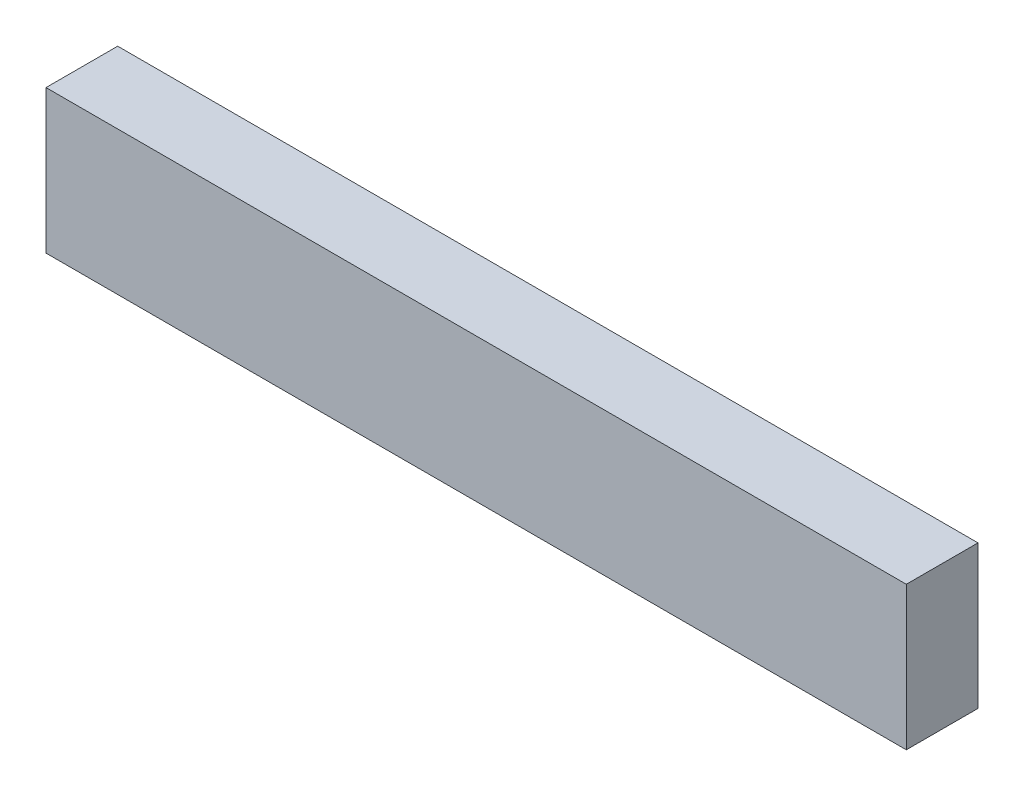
ISO-10303-21;
HEADER;
FILE_DESCRIPTION(('STEP AP214'),'2;1');
FILE_NAME('part.step','',(''),(''),'','','');
FILE_SCHEMA(('AUTOMOTIVE_DESIGN { 1 0 10303 214 1 1 1 1 }'));
ENDSEC;
DATA;
#1=APPLICATION_CONTEXT('core data for automotive mechanical design processes');
#2=APPLICATION_PROTOCOL_DEFINITION('international standard','automotive_design',2000,#1);
#3=PRODUCT_CONTEXT('',#1,'mechanical');
#4=PRODUCT('Part','Part','',(#3));
#5=PRODUCT_RELATED_PRODUCT_CATEGORY('part','',(#4));
#6=PRODUCT_DEFINITION_FORMATION('','',#4);
#7=PRODUCT_DEFINITION_CONTEXT('part definition',#1,'design');
#8=PRODUCT_DEFINITION('design','',#6,#7);
#9=PRODUCT_DEFINITION_SHAPE('','',#8);
#10=(LENGTH_UNIT() NAMED_UNIT(*) SI_UNIT(.MILLI.,.METRE.));
#11=(NAMED_UNIT(*) PLANE_ANGLE_UNIT() SI_UNIT($,.RADIAN.));
#12=(NAMED_UNIT(*) SI_UNIT($,.STERADIAN.) SOLID_ANGLE_UNIT());
#13=UNCERTAINTY_MEASURE_WITH_UNIT(LENGTH_MEASURE(1.E-05),#10,'distance_accuracy_value','');
#14=(GEOMETRIC_REPRESENTATION_CONTEXT(3) GLOBAL_UNCERTAINTY_ASSIGNED_CONTEXT((#13)) GLOBAL_UNIT_ASSIGNED_CONTEXT((#10,
#11,#12)) REPRESENTATION_CONTEXT('',''));
#15=CARTESIAN_POINT('',(0.,0.,0.));
#16=DIRECTION('',(0.,0.,1.));
#17=DIRECTION('',(1.,0.,0.));
#18=AXIS2_PLACEMENT_3D('',#15,#16,#17);
#19=CARTESIAN_POINT('',(-61.8344262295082,9.4469262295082,10.));
#20=DIRECTION('',(1.,0.,0.));
#21=DIRECTION('',(0.,0.,-1.));
#22=AXIS2_PLACEMENT_3D('',#19,#20,#21);
#23=PLANE('',#22);
#24=DIRECTION('',(0.,-1.,0.));
#25=VECTOR('',#24,1.);
#26=CARTESIAN_POINT('',(-61.8344262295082,9.4469262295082,0.));
#27=LINE('',#26,#25);
#28=CARTESIAN_POINT('',(-61.8344262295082,9.4469262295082,0.));
#29=VERTEX_POINT('',#28);
#30=CARTESIAN_POINT('',(-61.8344262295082,-10.5530737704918,0.));
#31=VERTEX_POINT('',#30);
#32=EDGE_CURVE('E392',#29,#31,#27,.T.);
#33=ORIENTED_EDGE('',*,*,#32,.T.);
#34=DIRECTION('',(0.,0.,-1.));
#35=VECTOR('',#34,1.);
#36=CARTESIAN_POINT('',(-61.8344262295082,-10.5530737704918,10.));
#37=LINE('',#36,#35);
#38=CARTESIAN_POINT('',(-61.8344262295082,-10.5530737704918,10.));
#39=VERTEX_POINT('',#38);
#40=EDGE_CURVE('E11',#39,#31,#37,.T.);
#41=ORIENTED_EDGE('',*,*,#40,.F.);
#42=DIRECTION('',(0.,-1.,0.));
#43=VECTOR('',#42,1.);
#44=CARTESIAN_POINT('',(-61.8344262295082,9.4469262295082,10.));
#45=LINE('',#44,#43);
#46=CARTESIAN_POINT('',(-61.8344262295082,9.4469262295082,10.));
#47=VERTEX_POINT('',#46);
#48=EDGE_CURVE('E410',#47,#39,#45,.T.);
#49=ORIENTED_EDGE('',*,*,#48,.F.);
#50=DIRECTION('',(0.,0.,-1.));
#51=VECTOR('',#50,1.);
#52=CARTESIAN_POINT('',(-61.8344262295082,9.4469262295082,10.));
#53=LINE('',#52,#51);
#54=EDGE_CURVE('E404',#47,#29,#53,.T.);
#55=ORIENTED_EDGE('',*,*,#54,.T.);
#56=EDGE_LOOP('',(#33,#41,#49,#55));
#57=FACE_BOUND('',#56,.T.);
#58=ADVANCED_FACE('F348',(#57),#23,.F.);
#59=CARTESIAN_POINT('',(-61.8344262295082,-10.5530737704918,10.));
#60=DIRECTION('',(0.,1.,0.));
#61=DIRECTION('',(0.,0.,1.));
#62=AXIS2_PLACEMENT_3D('',#59,#60,#61);
#63=PLANE('',#62);
#64=DIRECTION('',(1.,0.,0.));
#65=VECTOR('',#64,1.);
#66=CARTESIAN_POINT('',(-61.8344262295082,-10.5530737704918,0.));
#67=LINE('',#66,#65);
#68=CARTESIAN_POINT('',(58.1655737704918,-10.5530737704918,0.));
#69=VERTEX_POINT('',#68);
#70=EDGE_CURVE('E388',#31,#69,#67,.T.);
#71=ORIENTED_EDGE('',*,*,#70,.T.);
#72=DIRECTION('',(0.,0.,-1.));
#73=VECTOR('',#72,1.);
#74=CARTESIAN_POINT('',(58.1655737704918,-10.5530737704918,10.));
#75=LINE('',#74,#73);
#76=CARTESIAN_POINT('',(58.1655737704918,-10.5530737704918,10.));
#77=VERTEX_POINT('',#76);
#78=EDGE_CURVE('E355',#77,#69,#75,.T.);
#79=ORIENTED_EDGE('',*,*,#78,.F.);
#80=DIRECTION('',(1.,0.,0.));
#81=VECTOR('',#80,1.);
#82=CARTESIAN_POINT('',(-61.8344262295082,-10.5530737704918,10.));
#83=LINE('',#82,#81);
#84=EDGE_CURVE('E400',#39,#77,#83,.T.);
#85=ORIENTED_EDGE('',*,*,#84,.F.);
#86=ORIENTED_EDGE('',*,*,#40,.T.);
#87=EDGE_LOOP('',(#71,#79,#85,#86));
#88=FACE_BOUND('',#87,.T.);
#89=ADVANCED_FACE('F399',(#88),#63,.F.);
#90=CARTESIAN_POINT('',(58.1655737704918,9.4469262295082,10.));
#91=DIRECTION('',(-1.,0.,0.));
#92=DIRECTION('',(0.,0.,1.));
#93=AXIS2_PLACEMENT_3D('',#90,#91,#92);
#94=PLANE('',#93);
#95=DIRECTION('',(0.,1.,0.));
#96=VECTOR('',#95,1.);
#97=CARTESIAN_POINT('',(58.1655737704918,9.4469262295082,0.));
#98=LINE('',#97,#96);
#99=CARTESIAN_POINT('',(58.1655737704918,9.4469262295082,0.));
#100=VERTEX_POINT('',#99);
#101=EDGE_CURVE('E393',#69,#100,#98,.T.);
#102=ORIENTED_EDGE('',*,*,#101,.T.);
#103=DIRECTION('',(0.,0.,-1.));
#104=VECTOR('',#103,1.);
#105=CARTESIAN_POINT('',(58.1655737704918,9.4469262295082,10.));
#106=LINE('',#105,#104);
#107=CARTESIAN_POINT('',(58.1655737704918,9.4469262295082,10.));
#108=VERTEX_POINT('',#107);
#109=EDGE_CURVE('E416',#108,#100,#106,.T.);
#110=ORIENTED_EDGE('',*,*,#109,.F.);
#111=DIRECTION('',(0.,1.,0.));
#112=VECTOR('',#111,1.);
#113=CARTESIAN_POINT('',(58.1655737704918,9.4469262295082,10.));
#114=LINE('',#113,#112);
#115=EDGE_CURVE('E367',#77,#108,#114,.T.);
#116=ORIENTED_EDGE('',*,*,#115,.F.);
#117=ORIENTED_EDGE('',*,*,#78,.T.);
#118=EDGE_LOOP('',(#102,#110,#116,#117));
#119=FACE_BOUND('',#118,.T.);
#120=ADVANCED_FACE('F419',(#119),#94,.F.);
#121=CARTESIAN_POINT('',(-61.8344262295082,9.4469262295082,10.));
#122=DIRECTION('',(0.,-1.,0.));
#123=DIRECTION('',(0.,0.,-1.));
#124=AXIS2_PLACEMENT_3D('',#121,#122,#123);
#125=PLANE('',#124);
#126=DIRECTION('',(-1.,0.,0.));
#127=VECTOR('',#126,1.);
#128=CARTESIAN_POINT('',(-61.8344262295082,9.4469262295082,0.));
#129=LINE('',#128,#127);
#130=EDGE_CURVE('E408',#100,#29,#129,.T.);
#131=ORIENTED_EDGE('',*,*,#130,.T.);
#132=ORIENTED_EDGE('',*,*,#54,.F.);
#133=DIRECTION('',(-1.,0.,0.));
#134=VECTOR('',#133,1.);
#135=CARTESIAN_POINT('',(-61.8344262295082,9.4469262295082,10.));
#136=LINE('',#135,#134);
#137=EDGE_CURVE('E362',#108,#47,#136,.T.);
#138=ORIENTED_EDGE('',*,*,#137,.F.);
#139=ORIENTED_EDGE('',*,*,#109,.T.);
#140=EDGE_LOOP('',(#131,#132,#138,#139));
#141=FACE_BOUND('',#140,.T.);
#142=ADVANCED_FACE('F421',(#141),#125,.F.);
#143=CARTESIAN_POINT('',(-61.8344262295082,-10.5530737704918,10.));
#144=DIRECTION('',(0.,0.,1.));
#145=DIRECTION('',(1.,0.,0.));
#146=AXIS2_PLACEMENT_3D('',#143,#144,#145);
#147=PLANE('',#146);
#148=ORIENTED_EDGE('',*,*,#48,.T.);
#149=ORIENTED_EDGE('',*,*,#84,.T.);
#150=ORIENTED_EDGE('',*,*,#115,.T.);
#151=ORIENTED_EDGE('',*,*,#137,.T.);
#152=EDGE_LOOP('',(#148,#149,#150,#151));
#153=FACE_BOUND('',#152,.T.);
#154=ADVANCED_FACE('F422',(#153),#147,.T.);
#155=CARTESIAN_POINT('',(-61.8344262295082,-10.5530737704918,0.));
#156=DIRECTION('',(0.,0.,1.));
#157=DIRECTION('',(1.,0.,0.));
#158=AXIS2_PLACEMENT_3D('',#155,#156,#157);
#159=PLANE('',#158);
#160=ORIENTED_EDGE('',*,*,#32,.F.);
#161=ORIENTED_EDGE('',*,*,#130,.F.);
#162=ORIENTED_EDGE('',*,*,#101,.F.);
#163=ORIENTED_EDGE('',*,*,#70,.F.);
#164=EDGE_LOOP('',(#160,#161,#162,#163));
#165=FACE_BOUND('',#164,.T.);
#166=ADVANCED_FACE('F389',(#165),#159,.F.);
#167=CLOSED_SHELL('',(#58,#89,#120,#142,#154,#166));
#168=MANIFOLD_SOLID_BREP('B2',#167);
#169=ADVANCED_BREP_SHAPE_REPRESENTATION('',(#18,#168),#14);
#170=SHAPE_DEFINITION_REPRESENTATION(#9,#169);
ENDSEC;
END-ISO-10303-21;
